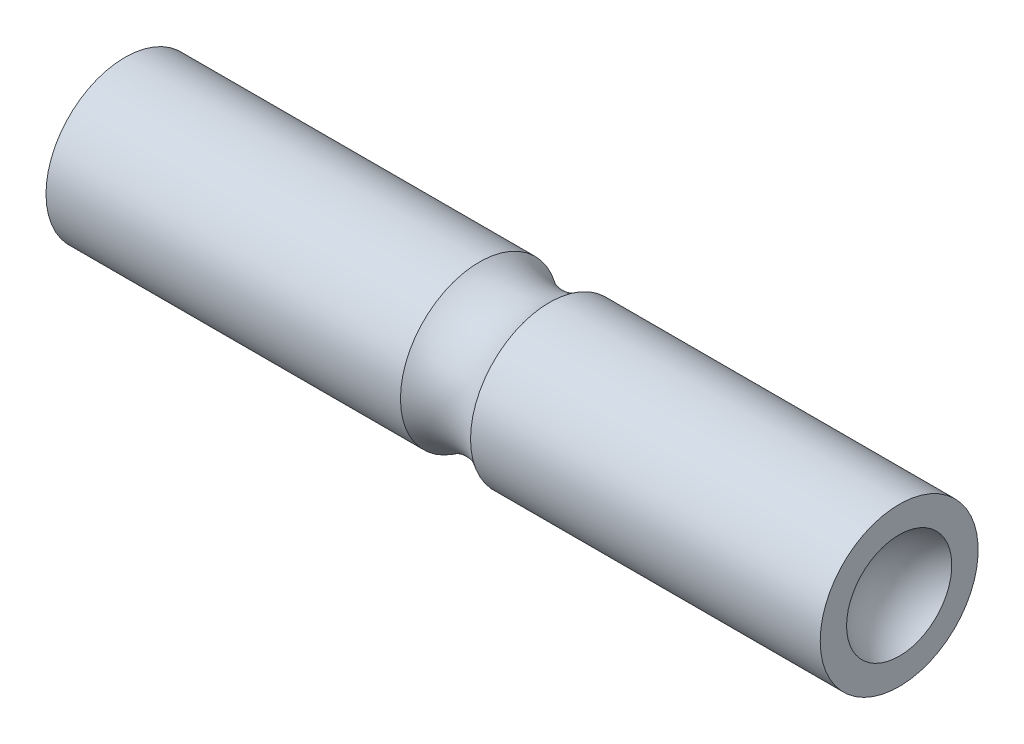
from build123d import *


with BuildPart() as part:
    # Sketch1 → Revolve1 (revolve)
    with BuildSketch(Plane.XY, mode=Mode.PRIVATE) as revolve1_sk:
        with BuildLine():
            Line((0, 0), (19.177, 0))
            ThreePointArc((19.177, 0), (19.381177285, 0.762), (19.939, 1.319822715))
            Line((19.939, 1.319822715), (19.939, 1.981))
            Line((19.939, 1.981), (11.165948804, 1.981))
            ThreePointArc((11.165948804, 1.981), (10.287, 1.702), (9.408051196, 1.981))
            Line((9.408051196, 1.981), (0.515516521, 1.981))
            ThreePointArc((0.515516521, 1.981), (0.130990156, 1.023488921), (0, 0))
        make_face()
    revolve(revolve1_sk.sketch.rotate(Axis((0, 0, 0), (1, 0, 0)), 90), axis=Axis((0, 0, 0), (1, 0, 0)))


solid = part.part
